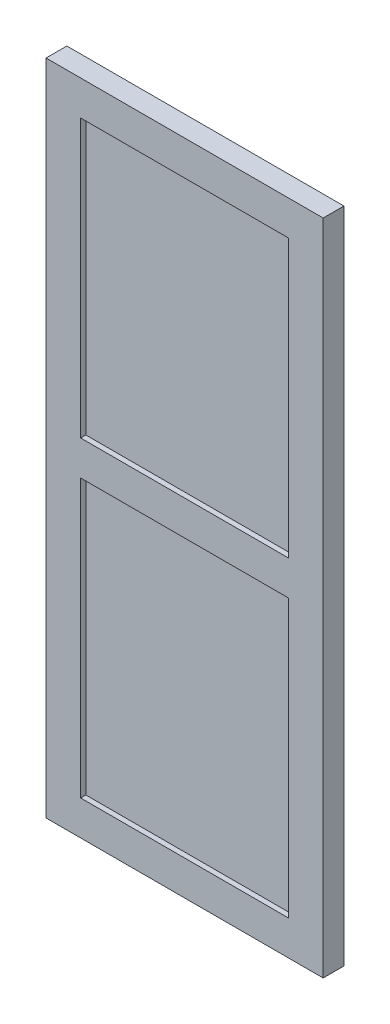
from build123d import *

# Parameters (mm, degrees)
SALIENTE_EXTRUIR1_DEPTH      = 30
SALIENTE_EXTRUIR1_DEPTH_BACK = 30
CROQUIS1_W                   = 800
CROQUIS1_H                   = 1900
CROQUIS1_W_2                 = 600
CROQUIS1_H_2                 = 800
SALIENTE_EXTRUIR2_DEPTH      = 15
SALIENTE_EXTRUIR2_DEPTH_BACK = 15
CROQUIS1_2_W                 = 600
CROQUIS1_2_H                 = 800


with BuildPart() as part:
    # Croquis1 → Saliente-Extruir1 (new, two sides: drawn at the far end of the back side and taken through both)
    with BuildSketch(Plane.XY.offset(-SALIENTE_EXTRUIR1_DEPTH_BACK)):
        with Locations((-188.352272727, -40.482954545)):
            Rectangle(CROQUIS1_W, CROQUIS1_H)
        with Locations((-188.352272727, 409.517045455)):
            Rectangle(CROQUIS1_W_2, CROQUIS1_H_2, mode=Mode.SUBTRACT)
        with Locations((-188.352272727, -490.482954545)):
            Rectangle(CROQUIS1_W_2, CROQUIS1_H_2, mode=Mode.SUBTRACT)
    extrude(amount=SALIENTE_EXTRUIR1_DEPTH + SALIENTE_EXTRUIR1_DEPTH_BACK)

    # Croquis1_2 → Saliente-Extruir2 (add, two sides: drawn at the far end of the back side and taken through both)
    with BuildSketch(Plane.XY.offset(-SALIENTE_EXTRUIR2_DEPTH_BACK)):
        with Locations((-188.352272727, 409.517045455)):
            Rectangle(CROQUIS1_2_W, CROQUIS1_2_H)
        with Locations((-188.352272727, -490.482954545)):
            Rectangle(CROQUIS1_2_W, CROQUIS1_2_H)
    extrude(amount=SALIENTE_EXTRUIR2_DEPTH + SALIENTE_EXTRUIR2_DEPTH_BACK)


solid = part.part
